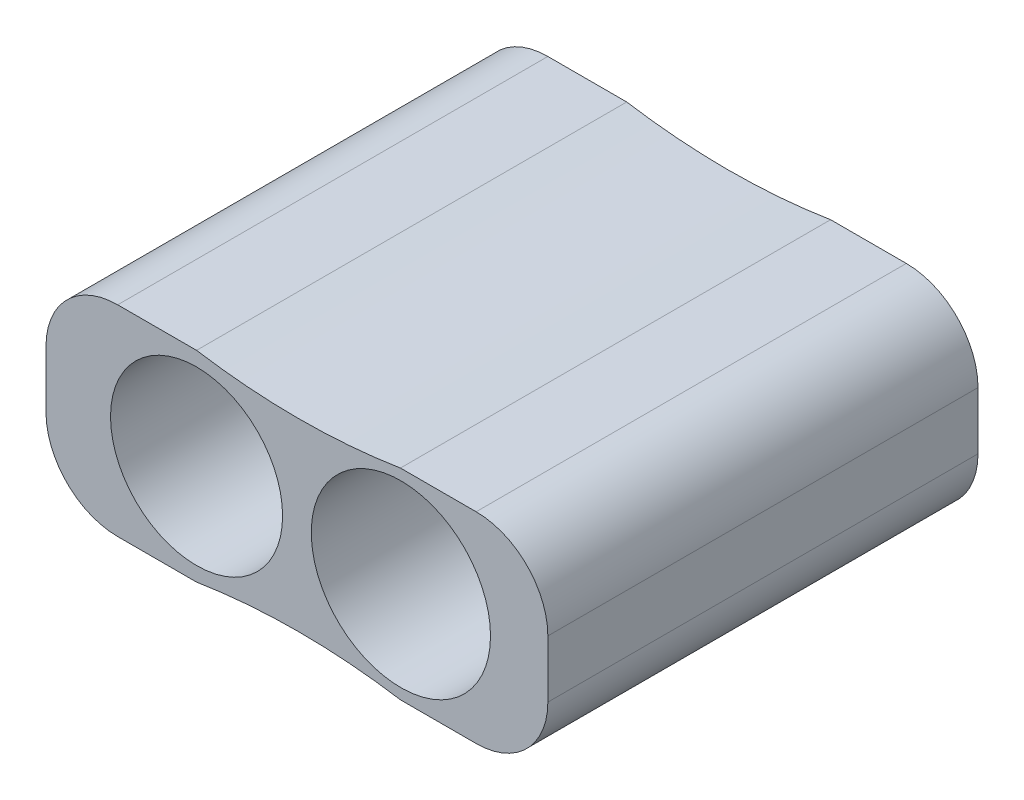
ISO-10303-21;
HEADER;
FILE_DESCRIPTION(('STEP AP214'),'2;1');
FILE_NAME('part.step','',(''),(''),'','','');
FILE_SCHEMA(('AUTOMOTIVE_DESIGN { 1 0 10303 214 1 1 1 1 }'));
ENDSEC;
DATA;
#1=APPLICATION_CONTEXT('core data for automotive mechanical design processes');
#2=APPLICATION_PROTOCOL_DEFINITION('international standard','automotive_design',2000,#1);
#3=PRODUCT_CONTEXT('',#1,'mechanical');
#4=PRODUCT('Part','Part','',(#3));
#5=PRODUCT_RELATED_PRODUCT_CATEGORY('part','',(#4));
#6=PRODUCT_DEFINITION_FORMATION('','',#4);
#7=PRODUCT_DEFINITION_CONTEXT('part definition',#1,'design');
#8=PRODUCT_DEFINITION('design','',#6,#7);
#9=PRODUCT_DEFINITION_SHAPE('','',#8);
#10=(LENGTH_UNIT() NAMED_UNIT(*) SI_UNIT(.MILLI.,.METRE.));
#11=(NAMED_UNIT(*) PLANE_ANGLE_UNIT() SI_UNIT($,.RADIAN.));
#12=(NAMED_UNIT(*) SI_UNIT($,.STERADIAN.) SOLID_ANGLE_UNIT());
#13=UNCERTAINTY_MEASURE_WITH_UNIT(LENGTH_MEASURE(1.E-05),#10,'distance_accuracy_value','');
#14=(GEOMETRIC_REPRESENTATION_CONTEXT(3) GLOBAL_UNCERTAINTY_ASSIGNED_CONTEXT((#13)) GLOBAL_UNIT_ASSIGNED_CONTEXT((#10,
#11,#12)) REPRESENTATION_CONTEXT('',''));
#15=CARTESIAN_POINT('',(0.,0.,0.));
#16=DIRECTION('',(0.,0.,1.));
#17=DIRECTION('',(1.,0.,0.));
#18=AXIS2_PLACEMENT_3D('',#15,#16,#17);
#19=CARTESIAN_POINT('',(0.,7.,15.));
#20=DIRECTION('',(0.,1.,0.));
#21=DIRECTION('',(0.,0.,1.));
#22=AXIS2_PLACEMENT_3D('',#19,#20,#21);
#23=PLANE('',#22);
#24=DIRECTION('',(1.,0.,0.));
#25=VECTOR('',#24,1.);
#26=CARTESIAN_POINT('',(0.,7.,15.));
#27=LINE('',#26,#25);
#28=CARTESIAN_POINT('',(7.22,7.,15.));
#29=VERTEX_POINT('',#28);
#30=CARTESIAN_POINT('',(12.5,7.,15.));
#31=VERTEX_POINT('',#30);
#32=EDGE_CURVE('E147',#29,#31,#27,.T.);
#33=ORIENTED_EDGE('',*,*,#32,.T.);
#34=DIRECTION('',(0.,0.,-1.));
#35=VECTOR('',#34,1.);
#36=CARTESIAN_POINT('',(12.5,7.,15.));
#37=LINE('',#36,#35);
#38=CARTESIAN_POINT('',(12.5,7.,-15.));
#39=VERTEX_POINT('',#38);
#40=EDGE_CURVE('E11',#31,#39,#37,.T.);
#41=ORIENTED_EDGE('',*,*,#40,.T.);
#42=DIRECTION('',(1.,0.,0.));
#43=VECTOR('',#42,1.);
#44=CARTESIAN_POINT('',(17.5,7.,-15.));
#45=LINE('',#44,#43);
#46=CARTESIAN_POINT('',(7.22000000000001,7.,-15.));
#47=VERTEX_POINT('',#46);
#48=EDGE_CURVE('E150',#47,#39,#45,.T.);
#49=ORIENTED_EDGE('',*,*,#48,.F.);
#50=DIRECTION('',(0.,0.,-1.));
#51=VECTOR('',#50,1.);
#52=CARTESIAN_POINT('',(7.22,7.,15.));
#53=LINE('',#52,#51);
#54=EDGE_CURVE('E137',#29,#47,#53,.T.);
#55=ORIENTED_EDGE('',*,*,#54,.F.);
#56=EDGE_LOOP('',(#33,#41,#49,#55));
#57=FACE_BOUND('',#56,.T.);
#58=ADVANCED_FACE('F41',(#57),#23,.T.);
#59=CARTESIAN_POINT('',(0.,-7.,15.));
#60=DIRECTION('',(0.,1.,0.));
#61=DIRECTION('',(0.,0.,1.));
#62=AXIS2_PLACEMENT_3D('',#59,#60,#61);
#63=PLANE('',#62);
#64=DIRECTION('',(-1.,0.,0.));
#65=VECTOR('',#64,1.);
#66=CARTESIAN_POINT('',(17.5,-7.,-15.));
#67=LINE('',#66,#65);
#68=CARTESIAN_POINT('',(12.5,-7.,-15.));
#69=VERTEX_POINT('',#68);
#70=CARTESIAN_POINT('',(7.22,-7.,-15.));
#71=VERTEX_POINT('',#70);
#72=EDGE_CURVE('E184',#69,#71,#67,.T.);
#73=ORIENTED_EDGE('',*,*,#72,.F.);
#74=DIRECTION('',(0.,0.,-1.));
#75=VECTOR('',#74,1.);
#76=CARTESIAN_POINT('',(12.5,-7.,15.));
#77=LINE('',#76,#75);
#78=CARTESIAN_POINT('',(12.5,-7.,15.));
#79=VERTEX_POINT('',#78);
#80=EDGE_CURVE('E206',#69,#79,#77,.F.);
#81=ORIENTED_EDGE('',*,*,#80,.T.);
#82=DIRECTION('',(1.,0.,0.));
#83=VECTOR('',#82,1.);
#84=CARTESIAN_POINT('',(0.,-7.,15.));
#85=LINE('',#84,#83);
#86=CARTESIAN_POINT('',(7.22,-7.,15.));
#87=VERTEX_POINT('',#86);
#88=EDGE_CURVE('E170',#87,#79,#85,.T.);
#89=ORIENTED_EDGE('',*,*,#88,.F.);
#90=DIRECTION('',(0.,0.,-1.));
#91=VECTOR('',#90,1.);
#92=CARTESIAN_POINT('',(7.22,-7.,15.));
#93=LINE('',#92,#91);
#94=EDGE_CURVE('E345',#87,#71,#93,.T.);
#95=ORIENTED_EDGE('',*,*,#94,.T.);
#96=EDGE_LOOP('',(#73,#81,#89,#95));
#97=FACE_BOUND('',#96,.T.);
#98=ADVANCED_FACE('F303',(#97),#63,.F.);
#99=CARTESIAN_POINT('',(-12.5,-7.,15.));
#100=VERTEX_POINT('',#99);
#101=CARTESIAN_POINT('',(-7.,-7.,15.));
#102=VERTEX_POINT('',#101);
#103=EDGE_CURVE('E171',#100,#102,#85,.T.);
#104=ORIENTED_EDGE('',*,*,#103,.F.);
#105=DIRECTION('',(0.,0.,-1.));
#106=VECTOR('',#105,1.);
#107=CARTESIAN_POINT('',(-12.5,-7.,15.));
#108=LINE('',#107,#106);
#109=CARTESIAN_POINT('',(-12.5,-7.,-15.));
#110=VERTEX_POINT('',#109);
#111=EDGE_CURVE('E219',#100,#110,#108,.T.);
#112=ORIENTED_EDGE('',*,*,#111,.T.);
#113=CARTESIAN_POINT('',(-7.,-7.,-15.));
#114=VERTEX_POINT('',#113);
#115=EDGE_CURVE('E266',#114,#110,#67,.T.);
#116=ORIENTED_EDGE('',*,*,#115,.F.);
#117=DIRECTION('',(0.,0.,-1.));
#118=VECTOR('',#117,1.);
#119=CARTESIAN_POINT('',(-7.,-7.,15.));
#120=LINE('',#119,#118);
#121=EDGE_CURVE('E342',#102,#114,#120,.T.);
#122=ORIENTED_EDGE('',*,*,#121,.F.);
#123=EDGE_LOOP('',(#104,#112,#116,#122));
#124=FACE_BOUND('',#123,.T.);
#125=ADVANCED_FACE('F276',(#124),#63,.F.);
#126=CARTESIAN_POINT('',(0.,0.,15.));
#127=DIRECTION('',(0.,0.,1.));
#128=DIRECTION('',(1.,0.,0.));
#129=AXIS2_PLACEMENT_3D('',#126,#127,#128);
#130=PLANE('',#129);
#131=ORIENTED_EDGE('',*,*,#88,.T.);
#132=CARTESIAN_POINT('',(12.5,-2.,15.));
#133=DIRECTION('',(0.,0.,1.));
#134=DIRECTION('',(1.,0.,0.));
#135=AXIS2_PLACEMENT_3D('',#132,#133,#134);
#136=CIRCLE('',#135,5.);
#137=CARTESIAN_POINT('',(17.5,-2.,15.));
#138=VERTEX_POINT('',#137);
#139=EDGE_CURVE('E216',#79,#138,#136,.T.);
#140=ORIENTED_EDGE('',*,*,#139,.T.);
#141=DIRECTION('',(0.,-1.,0.));
#142=VECTOR('',#141,1.);
#143=CARTESIAN_POINT('',(17.5,0.,15.));
#144=LINE('',#143,#142);
#145=CARTESIAN_POINT('',(17.5,2.,15.));
#146=VERTEX_POINT('',#145);
#147=EDGE_CURVE('E158',#146,#138,#144,.T.);
#148=ORIENTED_EDGE('',*,*,#147,.F.);
#149=CARTESIAN_POINT('',(12.5,2.,15.));
#150=DIRECTION('',(0.,0.,1.));
#151=DIRECTION('',(1.,0.,0.));
#152=AXIS2_PLACEMENT_3D('',#149,#150,#151);
#153=CIRCLE('',#152,5.);
#154=EDGE_CURVE('E57',#146,#31,#153,.T.);
#155=ORIENTED_EDGE('',*,*,#154,.T.);
#156=ORIENTED_EDGE('',*,*,#32,.F.);
#157=CARTESIAN_POINT('',(0.109999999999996,51.4347600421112,15.));
#158=DIRECTION('',(0.,0.,-1.));
#159=DIRECTION('',(-1.,0.,0.));
#160=AXIS2_PLACEMENT_3D('',#157,#158,#159);
#161=CIRCLE('',#160,45.);
#162=CARTESIAN_POINT('',(-7.,7.,15.));
#163=VERTEX_POINT('',#162);
#164=EDGE_CURVE('E133',#29,#163,#161,.T.);
#165=ORIENTED_EDGE('',*,*,#164,.T.);
#166=CARTESIAN_POINT('',(-12.5,7.,15.));
#167=VERTEX_POINT('',#166);
#168=EDGE_CURVE('E157',#167,#163,#27,.T.);
#169=ORIENTED_EDGE('',*,*,#168,.F.);
#170=CARTESIAN_POINT('',(-12.5,2.,15.));
#171=DIRECTION('',(0.,0.,1.));
#172=DIRECTION('',(1.,0.,0.));
#173=AXIS2_PLACEMENT_3D('',#170,#171,#172);
#174=CIRCLE('',#173,5.);
#175=CARTESIAN_POINT('',(-17.5,2.,15.));
#176=VERTEX_POINT('',#175);
#177=EDGE_CURVE('E211',#167,#176,#174,.T.);
#178=ORIENTED_EDGE('',*,*,#177,.T.);
#179=DIRECTION('',(0.,-1.,0.));
#180=VECTOR('',#179,1.);
#181=CARTESIAN_POINT('',(-17.5,0.,15.));
#182=LINE('',#181,#180);
#183=CARTESIAN_POINT('',(-17.5,-2.,15.));
#184=VERTEX_POINT('',#183);
#185=EDGE_CURVE('E162',#176,#184,#182,.T.);
#186=ORIENTED_EDGE('',*,*,#185,.T.);
#187=CARTESIAN_POINT('',(-12.5,-2.,15.));
#188=DIRECTION('',(0.,0.,1.));
#189=DIRECTION('',(1.,0.,0.));
#190=AXIS2_PLACEMENT_3D('',#187,#188,#189);
#191=CIRCLE('',#190,5.);
#192=EDGE_CURVE('E64',#184,#100,#191,.T.);
#193=ORIENTED_EDGE('',*,*,#192,.T.);
#194=ORIENTED_EDGE('',*,*,#103,.T.);
#195=CARTESIAN_POINT('',(0.109999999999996,-51.4347600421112,15.));
#196=DIRECTION('',(0.,0.,-1.));
#197=DIRECTION('',(-1.,0.,0.));
#198=AXIS2_PLACEMENT_3D('',#195,#196,#197);
#199=CIRCLE('',#198,45.);
#200=EDGE_CURVE('E351',#87,#102,#199,.F.);
#201=ORIENTED_EDGE('',*,*,#200,.F.);
#202=EDGE_LOOP('',(#131,#140,#148,#155,#156,#165,#169,#178,#186,#193,#194,#201));
#203=FACE_BOUND('',#202,.T.);
#204=CARTESIAN_POINT('',(7.25,0.,15.));
#205=DIRECTION('',(0.,0.,1.));
#206=DIRECTION('',(1.,0.,0.));
#207=AXIS2_PLACEMENT_3D('',#204,#205,#206);
#208=CIRCLE('',#207,6.25);
#209=CARTESIAN_POINT('',(13.5,0.,15.));
#210=VERTEX_POINT('',#209);
#211=EDGE_CURVE('E164',#210,#210,#208,.T.);
#212=ORIENTED_EDGE('',*,*,#211,.F.);
#213=EDGE_LOOP('',(#212));
#214=FACE_BOUND('',#213,.T.);
#215=CARTESIAN_POINT('',(-7.,0.,15.));
#216=DIRECTION('',(0.,0.,1.));
#217=DIRECTION('',(1.,0.,0.));
#218=AXIS2_PLACEMENT_3D('',#215,#216,#217);
#219=CIRCLE('',#218,6.);
#220=CARTESIAN_POINT('',(-1.,0.,15.));
#221=VERTEX_POINT('',#220);
#222=EDGE_CURVE('E174',#221,#221,#219,.T.);
#223=ORIENTED_EDGE('',*,*,#222,.F.);
#224=EDGE_LOOP('',(#223));
#225=FACE_BOUND('',#224,.T.);
#226=ADVANCED_FACE('F154',(#203,#214,#225),#130,.T.);
#227=CARTESIAN_POINT('',(0.,0.,-15.));
#228=DIRECTION('',(0.,0.,-1.));
#229=DIRECTION('',(-1.,0.,0.));
#230=AXIS2_PLACEMENT_3D('',#227,#228,#229);
#231=PLANE('',#230);
#232=DIRECTION('',(0.,-1.,0.));
#233=VECTOR('',#232,1.);
#234=CARTESIAN_POINT('',(17.5,7.,-15.));
#235=LINE('',#234,#233);
#236=CARTESIAN_POINT('',(17.5,2.,-15.));
#237=VERTEX_POINT('',#236);
#238=CARTESIAN_POINT('',(17.5,-2.,-15.));
#239=VERTEX_POINT('',#238);
#240=EDGE_CURVE('E263',#237,#239,#235,.T.);
#241=ORIENTED_EDGE('',*,*,#240,.T.);
#242=CARTESIAN_POINT('',(12.5,-2.,-15.));
#243=DIRECTION('',(0.,0.,-1.));
#244=DIRECTION('',(-1.,0.,0.));
#245=AXIS2_PLACEMENT_3D('',#242,#243,#244);
#246=CIRCLE('',#245,5.);
#247=EDGE_CURVE('E203',#239,#69,#246,.T.);
#248=ORIENTED_EDGE('',*,*,#247,.T.);
#249=ORIENTED_EDGE('',*,*,#72,.T.);
#250=CARTESIAN_POINT('',(0.109999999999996,-51.4347600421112,-15.));
#251=DIRECTION('',(0.,0.,-1.));
#252=DIRECTION('',(-1.,0.,0.));
#253=AXIS2_PLACEMENT_3D('',#250,#251,#252);
#254=CIRCLE('',#253,45.);
#255=EDGE_CURVE('E355',#71,#114,#254,.F.);
#256=ORIENTED_EDGE('',*,*,#255,.T.);
#257=ORIENTED_EDGE('',*,*,#115,.T.);
#258=CARTESIAN_POINT('',(-12.5,-2.,-15.));
#259=DIRECTION('',(0.,0.,-1.));
#260=DIRECTION('',(-1.,0.,0.));
#261=AXIS2_PLACEMENT_3D('',#258,#259,#260);
#262=CIRCLE('',#261,5.);
#263=CARTESIAN_POINT('',(-17.5,-2.,-15.));
#264=VERTEX_POINT('',#263);
#265=EDGE_CURVE('E200',#110,#264,#262,.T.);
#266=ORIENTED_EDGE('',*,*,#265,.T.);
#267=DIRECTION('',(0.,1.,0.));
#268=VECTOR('',#267,1.);
#269=CARTESIAN_POINT('',(-17.5,7.,-15.));
#270=LINE('',#269,#268);
#271=CARTESIAN_POINT('',(-17.5,2.,-15.));
#272=VERTEX_POINT('',#271);
#273=EDGE_CURVE('E244',#264,#272,#270,.T.);
#274=ORIENTED_EDGE('',*,*,#273,.T.);
#275=CARTESIAN_POINT('',(-12.5,2.,-15.));
#276=DIRECTION('',(0.,0.,-1.));
#277=DIRECTION('',(-1.,0.,0.));
#278=AXIS2_PLACEMENT_3D('',#275,#276,#277);
#279=CIRCLE('',#278,5.);
#280=CARTESIAN_POINT('',(-12.5,7.,-15.));
#281=VERTEX_POINT('',#280);
#282=EDGE_CURVE('E197',#272,#281,#279,.T.);
#283=ORIENTED_EDGE('',*,*,#282,.T.);
#284=CARTESIAN_POINT('',(-7.,7.,-15.));
#285=VERTEX_POINT('',#284);
#286=EDGE_CURVE('E234',#281,#285,#45,.T.);
#287=ORIENTED_EDGE('',*,*,#286,.T.);
#288=CARTESIAN_POINT('',(0.109999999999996,51.4347600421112,-15.));
#289=DIRECTION('',(0.,0.,-1.));
#290=DIRECTION('',(-1.,0.,0.));
#291=AXIS2_PLACEMENT_3D('',#288,#289,#290);
#292=CIRCLE('',#291,45.);
#293=EDGE_CURVE('E143',#47,#285,#292,.T.);
#294=ORIENTED_EDGE('',*,*,#293,.F.);
#295=ORIENTED_EDGE('',*,*,#48,.T.);
#296=CARTESIAN_POINT('',(12.5,2.,-15.));
#297=DIRECTION('',(0.,0.,-1.));
#298=DIRECTION('',(-1.,0.,0.));
#299=AXIS2_PLACEMENT_3D('',#296,#297,#298);
#300=CIRCLE('',#299,5.);
#301=EDGE_CURVE('E194',#39,#237,#300,.T.);
#302=ORIENTED_EDGE('',*,*,#301,.T.);
#303=EDGE_LOOP('',(#241,#248,#249,#256,#257,#266,#274,#283,#287,#294,#295,#302));
#304=FACE_BOUND('',#303,.T.);
#305=CARTESIAN_POINT('',(7.22,0.,-15.));
#306=DIRECTION('',(0.,0.,-1.));
#307=DIRECTION('',(-1.,0.,0.));
#308=AXIS2_PLACEMENT_3D('',#305,#306,#307);
#309=CIRCLE('',#308,5.);
#310=CARTESIAN_POINT('',(2.22,0.,-15.));
#311=VERTEX_POINT('',#310);
#312=EDGE_CURVE('E252',#311,#311,#309,.T.);
#313=ORIENTED_EDGE('',*,*,#312,.F.);
#314=EDGE_LOOP('',(#313));
#315=FACE_BOUND('',#314,.T.);
#316=CARTESIAN_POINT('',(-7.,0.,-15.));
#317=DIRECTION('',(0.,0.,-1.));
#318=DIRECTION('',(-1.,0.,0.));
#319=AXIS2_PLACEMENT_3D('',#316,#317,#318);
#320=CIRCLE('',#319,5.);
#321=CARTESIAN_POINT('',(-12.,0.,-15.));
#322=VERTEX_POINT('',#321);
#323=EDGE_CURVE('E362',#322,#322,#320,.T.);
#324=ORIENTED_EDGE('',*,*,#323,.F.);
#325=EDGE_LOOP('',(#324));
#326=FACE_BOUND('',#325,.T.);
#327=ADVANCED_FACE('F248',(#304,#315,#326),#231,.T.);
#328=CARTESIAN_POINT('',(17.5,0.,15.));
#329=DIRECTION('',(1.,0.,0.));
#330=DIRECTION('',(0.,0.,-1.));
#331=AXIS2_PLACEMENT_3D('',#328,#329,#330);
#332=PLANE('',#331);
#333=ORIENTED_EDGE('',*,*,#147,.T.);
#334=DIRECTION('',(0.,0.,-1.));
#335=VECTOR('',#334,1.);
#336=CARTESIAN_POINT('',(17.5,-2.,-15.));
#337=LINE('',#336,#335);
#338=EDGE_CURVE('E190',#138,#239,#337,.T.);
#339=ORIENTED_EDGE('',*,*,#338,.T.);
#340=ORIENTED_EDGE('',*,*,#240,.F.);
#341=DIRECTION('',(0.,0.,-1.));
#342=VECTOR('',#341,1.);
#343=CARTESIAN_POINT('',(17.5,2.,15.));
#344=LINE('',#343,#342);
#345=EDGE_CURVE('E178',#237,#146,#344,.F.);
#346=ORIENTED_EDGE('',*,*,#345,.T.);
#347=EDGE_LOOP('',(#333,#339,#340,#346));
#348=FACE_BOUND('',#347,.T.);
#349=ADVANCED_FACE('F313',(#348),#332,.T.);
#350=ORIENTED_EDGE('',*,*,#286,.F.);
#351=DIRECTION('',(0.,0.,-1.));
#352=VECTOR('',#351,1.);
#353=CARTESIAN_POINT('',(-12.5,7.,15.));
#354=LINE('',#353,#352);
#355=EDGE_CURVE('E50',#281,#167,#354,.F.);
#356=ORIENTED_EDGE('',*,*,#355,.T.);
#357=ORIENTED_EDGE('',*,*,#168,.T.);
#358=DIRECTION('',(0.,0.,-1.));
#359=VECTOR('',#358,1.);
#360=CARTESIAN_POINT('',(-7.,7.,15.));
#361=LINE('',#360,#359);
#362=EDGE_CURVE('E140',#163,#285,#361,.T.);
#363=ORIENTED_EDGE('',*,*,#362,.T.);
#364=EDGE_LOOP('',(#350,#356,#357,#363));
#365=FACE_BOUND('',#364,.T.);
#366=ADVANCED_FACE('F233',(#365),#23,.T.);
#367=CARTESIAN_POINT('',(-17.5,0.,15.));
#368=DIRECTION('',(1.,0.,0.));
#369=DIRECTION('',(0.,0.,-1.));
#370=AXIS2_PLACEMENT_3D('',#367,#368,#369);
#371=PLANE('',#370);
#372=ORIENTED_EDGE('',*,*,#273,.F.);
#373=DIRECTION('',(0.,0.,-1.));
#374=VECTOR('',#373,1.);
#375=CARTESIAN_POINT('',(-17.5,-2.,15.));
#376=LINE('',#375,#374);
#377=EDGE_CURVE('E227',#264,#184,#376,.F.);
#378=ORIENTED_EDGE('',*,*,#377,.T.);
#379=ORIENTED_EDGE('',*,*,#185,.F.);
#380=DIRECTION('',(0.,0.,-1.));
#381=VECTOR('',#380,1.);
#382=CARTESIAN_POINT('',(-17.5,2.,-15.));
#383=LINE('',#382,#381);
#384=EDGE_CURVE('E223',#176,#272,#383,.T.);
#385=ORIENTED_EDGE('',*,*,#384,.T.);
#386=EDGE_LOOP('',(#372,#378,#379,#385));
#387=FACE_BOUND('',#386,.T.);
#388=ADVANCED_FACE('F243',(#387),#371,.F.);
#389=CARTESIAN_POINT('',(7.25,0.,15.));
#390=DIRECTION('',(0.,0.,-1.));
#391=DIRECTION('',(-1.,0.,0.));
#392=AXIS2_PLACEMENT_3D('',#389,#390,#391);
#393=CYLINDRICAL_SURFACE('',#392,6.25);
#394=ORIENTED_EDGE('',*,*,#211,.T.);
#395=EDGE_LOOP('',(#394));
#396=FACE_BOUND('',#395,.T.);
#397=CARTESIAN_POINT('',(7.25,0.,0.));
#398=DIRECTION('',(0.,0.,1.));
#399=DIRECTION('',(1.,0.,0.));
#400=AXIS2_PLACEMENT_3D('',#397,#398,#399);
#401=CIRCLE('',#400,6.25);
#402=CARTESIAN_POINT('',(13.5,0.,0.));
#403=VERTEX_POINT('',#402);
#404=EDGE_CURVE('E179',#403,#403,#401,.T.);
#405=ORIENTED_EDGE('',*,*,#404,.F.);
#406=EDGE_LOOP('',(#405));
#407=FACE_BOUND('',#406,.T.);
#408=ADVANCED_FACE('F272',(#396,#407),#393,.F.);
#409=CARTESIAN_POINT('',(-7.,0.,15.));
#410=DIRECTION('',(0.,0.,-1.));
#411=DIRECTION('',(-1.,0.,0.));
#412=AXIS2_PLACEMENT_3D('',#409,#410,#411);
#413=CYLINDRICAL_SURFACE('',#412,6.);
#414=ORIENTED_EDGE('',*,*,#222,.T.);
#415=EDGE_LOOP('',(#414));
#416=FACE_BOUND('',#415,.T.);
#417=CARTESIAN_POINT('',(-7.,0.,0.));
#418=DIRECTION('',(0.,0.,1.));
#419=DIRECTION('',(1.,0.,0.));
#420=AXIS2_PLACEMENT_3D('',#417,#418,#419);
#421=CIRCLE('',#420,6.);
#422=CARTESIAN_POINT('',(-1.,0.,0.));
#423=VERTEX_POINT('',#422);
#424=EDGE_CURVE('E183',#423,#423,#421,.T.);
#425=ORIENTED_EDGE('',*,*,#424,.F.);
#426=EDGE_LOOP('',(#425));
#427=FACE_BOUND('',#426,.T.);
#428=ADVANCED_FACE('F280',(#416,#427),#413,.F.);
#429=CARTESIAN_POINT('',(0.,0.,0.));
#430=DIRECTION('',(0.,0.,-1.));
#431=DIRECTION('',(-1.,0.,0.));
#432=AXIS2_PLACEMENT_3D('',#429,#430,#431);
#433=PLANE('',#432);
#434=CARTESIAN_POINT('',(7.22,0.,0.));
#435=DIRECTION('',(0.,0.,-1.));
#436=DIRECTION('',(-1.,0.,0.));
#437=AXIS2_PLACEMENT_3D('',#434,#435,#436);
#438=CIRCLE('',#437,5.);
#439=CARTESIAN_POINT('',(2.22,0.,0.));
#440=VERTEX_POINT('',#439);
#441=EDGE_CURVE('E258',#440,#440,#438,.T.);
#442=ORIENTED_EDGE('',*,*,#441,.T.);
#443=EDGE_LOOP('',(#442));
#444=FACE_BOUND('',#443,.T.);
#445=ORIENTED_EDGE('',*,*,#404,.T.);
#446=EDGE_LOOP('',(#445));
#447=FACE_BOUND('',#446,.T.);
#448=ADVANCED_FACE('F283',(#444,#447),#433,.F.);
#449=CARTESIAN_POINT('',(-7.,0.,0.));
#450=DIRECTION('',(0.,0.,-1.));
#451=DIRECTION('',(-1.,0.,0.));
#452=AXIS2_PLACEMENT_3D('',#449,#450,#451);
#453=CIRCLE('',#452,5.);
#454=CARTESIAN_POINT('',(-12.,0.,0.));
#455=VERTEX_POINT('',#454);
#456=EDGE_CURVE('E349',#455,#455,#453,.T.);
#457=ORIENTED_EDGE('',*,*,#456,.T.);
#458=EDGE_LOOP('',(#457));
#459=FACE_BOUND('',#458,.T.);
#460=ORIENTED_EDGE('',*,*,#424,.T.);
#461=EDGE_LOOP('',(#460));
#462=FACE_BOUND('',#461,.T.);
#463=ADVANCED_FACE('F287',(#459,#462),#433,.F.);
#464=CARTESIAN_POINT('',(7.22,0.,-15.));
#465=DIRECTION('',(0.,0.,1.));
#466=DIRECTION('',(1.,0.,0.));
#467=AXIS2_PLACEMENT_3D('',#464,#465,#466);
#468=CYLINDRICAL_SURFACE('',#467,5.);
#469=ORIENTED_EDGE('',*,*,#312,.T.);
#470=EDGE_LOOP('',(#469));
#471=FACE_BOUND('',#470,.T.);
#472=ORIENTED_EDGE('',*,*,#441,.F.);
#473=EDGE_LOOP('',(#472));
#474=FACE_BOUND('',#473,.T.);
#475=ADVANCED_FACE('F289',(#471,#474),#468,.F.);
#476=CARTESIAN_POINT('',(-7.,0.,-15.));
#477=DIRECTION('',(0.,0.,1.));
#478=DIRECTION('',(1.,0.,0.));
#479=AXIS2_PLACEMENT_3D('',#476,#477,#478);
#480=CYLINDRICAL_SURFACE('',#479,5.);
#481=ORIENTED_EDGE('',*,*,#323,.T.);
#482=EDGE_LOOP('',(#481));
#483=FACE_BOUND('',#482,.T.);
#484=ORIENTED_EDGE('',*,*,#456,.F.);
#485=EDGE_LOOP('',(#484));
#486=FACE_BOUND('',#485,.T.);
#487=ADVANCED_FACE('F296',(#483,#486),#480,.F.);
#488=CARTESIAN_POINT('',(0.109999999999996,-51.4347600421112,15.));
#489=DIRECTION('',(0.,0.,-1.));
#490=DIRECTION('',(-1.,0.,0.));
#491=AXIS2_PLACEMENT_3D('',#488,#489,#490);
#492=CYLINDRICAL_SURFACE('',#491,45.);
#493=ORIENTED_EDGE('',*,*,#255,.F.);
#494=ORIENTED_EDGE('',*,*,#94,.F.);
#495=ORIENTED_EDGE('',*,*,#200,.T.);
#496=ORIENTED_EDGE('',*,*,#121,.T.);
#497=EDGE_LOOP('',(#493,#494,#495,#496));
#498=FACE_BOUND('',#497,.T.);
#499=ADVANCED_FACE('F370',(#498),#492,.F.);
#500=CARTESIAN_POINT('',(0.109999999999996,51.4347600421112,15.));
#501=DIRECTION('',(0.,0.,-1.));
#502=DIRECTION('',(-1.,0.,0.));
#503=AXIS2_PLACEMENT_3D('',#500,#501,#502);
#504=CYLINDRICAL_SURFACE('',#503,45.);
#505=ORIENTED_EDGE('',*,*,#293,.T.);
#506=ORIENTED_EDGE('',*,*,#362,.F.);
#507=ORIENTED_EDGE('',*,*,#164,.F.);
#508=ORIENTED_EDGE('',*,*,#54,.T.);
#509=EDGE_LOOP('',(#505,#506,#507,#508));
#510=FACE_BOUND('',#509,.T.);
#511=ADVANCED_FACE('F136',(#510),#504,.F.);
#512=CARTESIAN_POINT('',(12.5,-2.,15.));
#513=DIRECTION('',(0.,0.,1.));
#514=DIRECTION('',(1.,0.,0.));
#515=AXIS2_PLACEMENT_3D('',#512,#513,#514);
#516=CYLINDRICAL_SURFACE('',#515,5.);
#517=ORIENTED_EDGE('',*,*,#139,.F.);
#518=ORIENTED_EDGE('',*,*,#80,.F.);
#519=ORIENTED_EDGE('',*,*,#247,.F.);
#520=ORIENTED_EDGE('',*,*,#338,.F.);
#521=EDGE_LOOP('',(#517,#518,#519,#520));
#522=FACE_BOUND('',#521,.T.);
#523=ADVANCED_FACE('F325',(#522),#516,.T.);
#524=CARTESIAN_POINT('',(-12.5,-2.,15.));
#525=DIRECTION('',(0.,0.,-1.));
#526=DIRECTION('',(-1.,0.,0.));
#527=AXIS2_PLACEMENT_3D('',#524,#525,#526);
#528=CYLINDRICAL_SURFACE('',#527,5.);
#529=ORIENTED_EDGE('',*,*,#192,.F.);
#530=ORIENTED_EDGE('',*,*,#377,.F.);
#531=ORIENTED_EDGE('',*,*,#265,.F.);
#532=ORIENTED_EDGE('',*,*,#111,.F.);
#533=EDGE_LOOP('',(#529,#530,#531,#532));
#534=FACE_BOUND('',#533,.T.);
#535=ADVANCED_FACE('F328',(#534),#528,.T.);
#536=CARTESIAN_POINT('',(-12.5,2.,15.));
#537=DIRECTION('',(0.,0.,1.));
#538=DIRECTION('',(1.,0.,0.));
#539=AXIS2_PLACEMENT_3D('',#536,#537,#538);
#540=CYLINDRICAL_SURFACE('',#539,5.);
#541=ORIENTED_EDGE('',*,*,#177,.F.);
#542=ORIENTED_EDGE('',*,*,#355,.F.);
#543=ORIENTED_EDGE('',*,*,#282,.F.);
#544=ORIENTED_EDGE('',*,*,#384,.F.);
#545=EDGE_LOOP('',(#541,#542,#543,#544));
#546=FACE_BOUND('',#545,.T.);
#547=ADVANCED_FACE('F239',(#546),#540,.T.);
#548=CARTESIAN_POINT('',(12.5,2.,15.));
#549=DIRECTION('',(0.,0.,-1.));
#550=DIRECTION('',(-1.,0.,0.));
#551=AXIS2_PLACEMENT_3D('',#548,#549,#550);
#552=CYLINDRICAL_SURFACE('',#551,5.);
#553=ORIENTED_EDGE('',*,*,#154,.F.);
#554=ORIENTED_EDGE('',*,*,#345,.F.);
#555=ORIENTED_EDGE('',*,*,#301,.F.);
#556=ORIENTED_EDGE('',*,*,#40,.F.);
#557=EDGE_LOOP('',(#553,#554,#555,#556));
#558=FACE_BOUND('',#557,.T.);
#559=ADVANCED_FACE('F43',(#558),#552,.T.);
#560=CLOSED_SHELL('',(#58,#98,#125,#226,#327,#349,#366,#388,#408,#428,#448,#463,#475,#487,#499,
#511,#523,#535,#547,#559));
#561=MANIFOLD_SOLID_BREP('B2',#560);
#562=ADVANCED_BREP_SHAPE_REPRESENTATION('',(#18,#561),#14);
#563=SHAPE_DEFINITION_REPRESENTATION(#9,#562);
ENDSEC;
END-ISO-10303-21;
